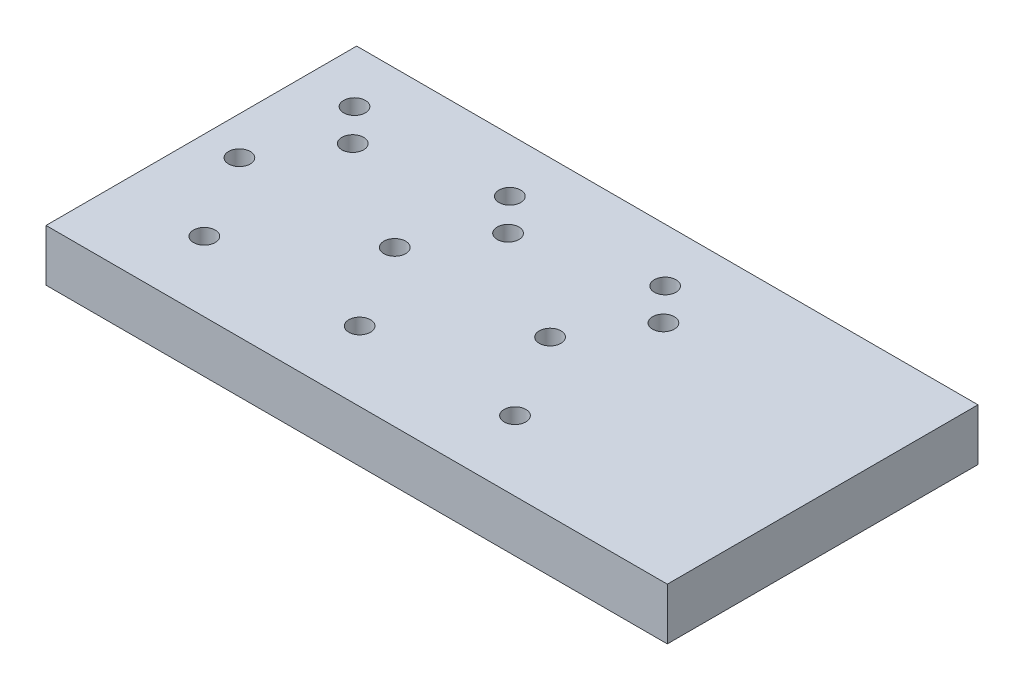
ISO-10303-21;
HEADER;
FILE_DESCRIPTION(('STEP AP214'),'2;1');
FILE_NAME('part.step','',(''),(''),'','','');
FILE_SCHEMA(('AUTOMOTIVE_DESIGN { 1 0 10303 214 1 1 1 1 }'));
ENDSEC;
DATA;
#1=APPLICATION_CONTEXT('core data for automotive mechanical design processes');
#2=APPLICATION_PROTOCOL_DEFINITION('international standard','automotive_design',2000,#1);
#3=PRODUCT_CONTEXT('',#1,'mechanical');
#4=PRODUCT('Part','Part','',(#3));
#5=PRODUCT_RELATED_PRODUCT_CATEGORY('part','',(#4));
#6=PRODUCT_DEFINITION_FORMATION('','',#4);
#7=PRODUCT_DEFINITION_CONTEXT('part definition',#1,'design');
#8=PRODUCT_DEFINITION('design','',#6,#7);
#9=PRODUCT_DEFINITION_SHAPE('','',#8);
#10=(LENGTH_UNIT() NAMED_UNIT(*) SI_UNIT(.MILLI.,.METRE.));
#11=(NAMED_UNIT(*) PLANE_ANGLE_UNIT() SI_UNIT($,.RADIAN.));
#12=(NAMED_UNIT(*) SI_UNIT($,.STERADIAN.) SOLID_ANGLE_UNIT());
#13=UNCERTAINTY_MEASURE_WITH_UNIT(LENGTH_MEASURE(1.E-05),#10,'distance_accuracy_value','');
#14=(GEOMETRIC_REPRESENTATION_CONTEXT(3) GLOBAL_UNCERTAINTY_ASSIGNED_CONTEXT((#13)) GLOBAL_UNIT_ASSIGNED_CONTEXT((#10,
#11,#12)) REPRESENTATION_CONTEXT('',''));
#15=CARTESIAN_POINT('',(0.,0.,0.));
#16=DIRECTION('',(0.,0.,1.));
#17=DIRECTION('',(1.,0.,0.));
#18=AXIS2_PLACEMENT_3D('',#15,#16,#17);
#19=CARTESIAN_POINT('',(60.,10.,-30.));
#20=DIRECTION('',(-1.,0.,0.));
#21=DIRECTION('',(0.,0.,1.));
#22=AXIS2_PLACEMENT_3D('',#19,#20,#21);
#23=PLANE('',#22);
#24=DIRECTION('',(0.,0.,-1.));
#25=VECTOR('',#24,1.);
#26=CARTESIAN_POINT('',(60.,0.,-30.));
#27=LINE('',#26,#25);
#28=CARTESIAN_POINT('',(60.,0.,30.));
#29=VERTEX_POINT('',#28);
#30=CARTESIAN_POINT('',(60.,0.,-30.));
#31=VERTEX_POINT('',#30);
#32=EDGE_CURVE('E102',#29,#31,#27,.T.);
#33=ORIENTED_EDGE('',*,*,#32,.T.);
#34=DIRECTION('',(0.,-1.,0.));
#35=VECTOR('',#34,1.);
#36=CARTESIAN_POINT('',(60.,10.,-30.));
#37=LINE('',#36,#35);
#38=CARTESIAN_POINT('',(60.,10.,-30.));
#39=VERTEX_POINT('',#38);
#40=EDGE_CURVE('E93',#39,#31,#37,.T.);
#41=ORIENTED_EDGE('',*,*,#40,.F.);
#42=DIRECTION('',(0.,0.,-1.));
#43=VECTOR('',#42,1.);
#44=CARTESIAN_POINT('',(60.,10.,-30.));
#45=LINE('',#44,#43);
#46=CARTESIAN_POINT('',(60.,10.,30.));
#47=VERTEX_POINT('',#46);
#48=EDGE_CURVE('E87',#47,#39,#45,.T.);
#49=ORIENTED_EDGE('',*,*,#48,.F.);
#50=DIRECTION('',(0.,-1.,0.));
#51=VECTOR('',#50,1.);
#52=CARTESIAN_POINT('',(60.,10.,30.));
#53=LINE('',#52,#51);
#54=EDGE_CURVE('E98',#47,#29,#53,.T.);
#55=ORIENTED_EDGE('',*,*,#54,.T.);
#56=EDGE_LOOP('',(#33,#41,#49,#55));
#57=FACE_BOUND('',#56,.T.);
#58=ADVANCED_FACE('F33',(#57),#23,.F.);
#59=CARTESIAN_POINT('',(60.,10.,-30.));
#60=DIRECTION('',(0.,0.,1.));
#61=DIRECTION('',(1.,0.,0.));
#62=AXIS2_PLACEMENT_3D('',#59,#60,#61);
#63=PLANE('',#62);
#64=DIRECTION('',(-1.,0.,0.));
#65=VECTOR('',#64,1.);
#66=CARTESIAN_POINT('',(60.,0.,-30.));
#67=LINE('',#66,#65);
#68=CARTESIAN_POINT('',(-60.,0.,-30.));
#69=VERTEX_POINT('',#68);
#70=EDGE_CURVE('E92',#31,#69,#67,.T.);
#71=ORIENTED_EDGE('',*,*,#70,.T.);
#72=DIRECTION('',(0.,-1.,0.));
#73=VECTOR('',#72,1.);
#74=CARTESIAN_POINT('',(-60.,10.,-30.));
#75=LINE('',#74,#73);
#76=CARTESIAN_POINT('',(-60.,10.,-30.));
#77=VERTEX_POINT('',#76);
#78=EDGE_CURVE('E90',#77,#69,#75,.T.);
#79=ORIENTED_EDGE('',*,*,#78,.F.);
#80=DIRECTION('',(-1.,0.,0.));
#81=VECTOR('',#80,1.);
#82=CARTESIAN_POINT('',(60.,10.,-30.));
#83=LINE('',#82,#81);
#84=EDGE_CURVE('E81',#39,#77,#83,.T.);
#85=ORIENTED_EDGE('',*,*,#84,.F.);
#86=ORIENTED_EDGE('',*,*,#40,.T.);
#87=EDGE_LOOP('',(#71,#79,#85,#86));
#88=FACE_BOUND('',#87,.T.);
#89=ADVANCED_FACE('F91',(#88),#63,.F.);
#90=CARTESIAN_POINT('',(-60.,10.,-30.));
#91=DIRECTION('',(1.,0.,0.));
#92=DIRECTION('',(0.,0.,-1.));
#93=AXIS2_PLACEMENT_3D('',#90,#91,#92);
#94=PLANE('',#93);
#95=DIRECTION('',(0.,0.,1.));
#96=VECTOR('',#95,1.);
#97=CARTESIAN_POINT('',(-60.,0.,-30.));
#98=LINE('',#97,#96);
#99=CARTESIAN_POINT('',(-60.,0.,30.));
#100=VERTEX_POINT('',#99);
#101=EDGE_CURVE('E67',#69,#100,#98,.T.);
#102=ORIENTED_EDGE('',*,*,#101,.T.);
#103=DIRECTION('',(0.,-1.,0.));
#104=VECTOR('',#103,1.);
#105=CARTESIAN_POINT('',(-60.,10.,30.));
#106=LINE('',#105,#104);
#107=CARTESIAN_POINT('',(-60.,10.,30.));
#108=VERTEX_POINT('',#107);
#109=EDGE_CURVE('E94',#108,#100,#106,.T.);
#110=ORIENTED_EDGE('',*,*,#109,.F.);
#111=DIRECTION('',(0.,0.,1.));
#112=VECTOR('',#111,1.);
#113=CARTESIAN_POINT('',(-60.,10.,-30.));
#114=LINE('',#113,#112);
#115=EDGE_CURVE('E85',#77,#108,#114,.T.);
#116=ORIENTED_EDGE('',*,*,#115,.F.);
#117=ORIENTED_EDGE('',*,*,#78,.T.);
#118=EDGE_LOOP('',(#102,#110,#116,#117));
#119=FACE_BOUND('',#118,.T.);
#120=ADVANCED_FACE('F96',(#119),#94,.F.);
#121=CARTESIAN_POINT('',(60.,10.,30.));
#122=DIRECTION('',(0.,0.,-1.));
#123=DIRECTION('',(-1.,0.,0.));
#124=AXIS2_PLACEMENT_3D('',#121,#122,#123);
#125=PLANE('',#124);
#126=DIRECTION('',(1.,0.,0.));
#127=VECTOR('',#126,1.);
#128=CARTESIAN_POINT('',(60.,0.,30.));
#129=LINE('',#128,#127);
#130=EDGE_CURVE('E73',#100,#29,#129,.T.);
#131=ORIENTED_EDGE('',*,*,#130,.T.);
#132=ORIENTED_EDGE('',*,*,#54,.F.);
#133=DIRECTION('',(1.,0.,0.));
#134=VECTOR('',#133,1.);
#135=CARTESIAN_POINT('',(60.,10.,30.));
#136=LINE('',#135,#134);
#137=EDGE_CURVE('E50',#108,#47,#136,.T.);
#138=ORIENTED_EDGE('',*,*,#137,.F.);
#139=ORIENTED_EDGE('',*,*,#109,.T.);
#140=EDGE_LOOP('',(#131,#132,#138,#139));
#141=FACE_BOUND('',#140,.T.);
#142=ADVANCED_FACE('F161',(#141),#125,.F.);
#143=CARTESIAN_POINT('',(60.,10.,30.));
#144=DIRECTION('',(0.,-1.,0.));
#145=DIRECTION('',(0.,0.,-1.));
#146=AXIS2_PLACEMENT_3D('',#143,#144,#145);
#147=PLANE('',#146);
#148=CARTESIAN_POINT('',(-22.6459660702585,10.,0.));
#149=DIRECTION('',(0.,1.,0.));
#150=DIRECTION('',(0.,0.,1.));
#151=AXIS2_PLACEMENT_3D('',#148,#149,#150);
#152=CIRCLE('',#151,2.09999999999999);
#153=CARTESIAN_POINT('',(-22.6459660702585,10.,2.09999999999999));
#154=VERTEX_POINT('',#153);
#155=EDGE_CURVE('E358',#154,#154,#152,.T.);
#156=ORIENTED_EDGE('',*,*,#155,.F.);
#157=EDGE_LOOP('',(#156));
#158=FACE_BOUND('',#157,.T.);
#159=CARTESIAN_POINT('',(-14.0694165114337,10.,-13.312797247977));
#160=DIRECTION('',(0.,1.,0.));
#161=DIRECTION('',(0.,0.,1.));
#162=AXIS2_PLACEMENT_3D('',#159,#160,#161);
#163=CIRCLE('',#162,2.09999999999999);
#164=CARTESIAN_POINT('',(-14.0694165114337,10.,-11.212797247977));
#165=VERTEX_POINT('',#164);
#166=EDGE_CURVE('E352',#165,#165,#163,.T.);
#167=ORIENTED_EDGE('',*,*,#166,.F.);
#168=EDGE_LOOP('',(#167));
#169=FACE_BOUND('',#168,.T.);
#170=CARTESIAN_POINT('',(-20.0812472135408,10.,-19.6611191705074));
#171=DIRECTION('',(0.,1.,0.));
#172=DIRECTION('',(0.,0.,1.));
#173=AXIS2_PLACEMENT_3D('',#170,#171,#172);
#174=CIRCLE('',#173,2.09999999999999);
#175=CARTESIAN_POINT('',(-20.0812472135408,10.,-17.5611191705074));
#176=VERTEX_POINT('',#175);
#177=EDGE_CURVE('E346',#176,#176,#174,.T.);
#178=ORIENTED_EDGE('',*,*,#177,.F.);
#179=EDGE_LOOP('',(#178));
#180=FACE_BOUND('',#179,.T.);
#181=CARTESIAN_POINT('',(-12.8913139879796,10.,16.5317198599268));
#182=DIRECTION('',(0.,1.,0.));
#183=DIRECTION('',(0.,0.,1.));
#184=AXIS2_PLACEMENT_3D('',#181,#182,#183);
#185=CIRCLE('',#184,2.09999999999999);
#186=CARTESIAN_POINT('',(-12.8913139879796,10.,18.6317198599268));
#187=VERTEX_POINT('',#186);
#188=EDGE_CURVE('E340',#187,#187,#185,.T.);
#189=ORIENTED_EDGE('',*,*,#188,.F.);
#190=EDGE_LOOP('',(#189));
#191=FACE_BOUND('',#190,.T.);
#192=CARTESIAN_POINT('',(-42.8913139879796,10.,16.5317198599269));
#193=DIRECTION('',(0.,1.,0.));
#194=DIRECTION('',(0.,0.,1.));
#195=AXIS2_PLACEMENT_3D('',#192,#193,#194);
#196=CIRCLE('',#195,2.09999999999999);
#197=CARTESIAN_POINT('',(-42.8913139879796,10.,18.6317198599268));
#198=VERTEX_POINT('',#197);
#199=EDGE_CURVE('E127',#198,#198,#196,.T.);
#200=ORIENTED_EDGE('',*,*,#199,.F.);
#201=EDGE_LOOP('',(#200));
#202=FACE_BOUND('',#201,.T.);
#203=CARTESIAN_POINT('',(-52.6459660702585,10.,0.));
#204=DIRECTION('',(0.,1.,0.));
#205=DIRECTION('',(0.,0.,1.));
#206=AXIS2_PLACEMENT_3D('',#203,#204,#205);
#207=CIRCLE('',#206,2.09999999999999);
#208=CARTESIAN_POINT('',(-52.6459660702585,10.,2.09999999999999));
#209=VERTEX_POINT('',#208);
#210=EDGE_CURVE('E123',#209,#209,#207,.T.);
#211=ORIENTED_EDGE('',*,*,#210,.F.);
#212=EDGE_LOOP('',(#211));
#213=FACE_BOUND('',#212,.T.);
#214=CARTESIAN_POINT('',(-44.0694165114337,10.,-13.312797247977));
#215=DIRECTION('',(0.,1.,0.));
#216=DIRECTION('',(0.,0.,1.));
#217=AXIS2_PLACEMENT_3D('',#214,#215,#216);
#218=CIRCLE('',#217,2.09999999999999);
#219=CARTESIAN_POINT('',(-44.0694165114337,10.,-11.212797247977));
#220=VERTEX_POINT('',#219);
#221=EDGE_CURVE('E119',#220,#220,#218,.T.);
#222=ORIENTED_EDGE('',*,*,#221,.F.);
#223=EDGE_LOOP('',(#222));
#224=FACE_BOUND('',#223,.T.);
#225=CARTESIAN_POINT('',(-50.0812472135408,10.,-19.6611191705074));
#226=DIRECTION('',(0.,1.,0.));
#227=DIRECTION('',(0.,0.,1.));
#228=AXIS2_PLACEMENT_3D('',#225,#226,#227);
#229=CIRCLE('',#228,2.09999999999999);
#230=CARTESIAN_POINT('',(-50.0812472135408,10.,-17.5611191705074));
#231=VERTEX_POINT('',#230);
#232=EDGE_CURVE('E115',#231,#231,#229,.T.);
#233=ORIENTED_EDGE('',*,*,#232,.F.);
#234=EDGE_LOOP('',(#233));
#235=FACE_BOUND('',#234,.T.);
#236=ORIENTED_EDGE('',*,*,#48,.T.);
#237=ORIENTED_EDGE('',*,*,#84,.T.);
#238=ORIENTED_EDGE('',*,*,#115,.T.);
#239=ORIENTED_EDGE('',*,*,#137,.T.);
#240=EDGE_LOOP('',(#236,#237,#238,#239));
#241=FACE_BOUND('',#240,.T.);
#242=CARTESIAN_POINT('',(17.1086860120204,10.,16.5317198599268));
#243=DIRECTION('',(0.,1.,0.));
#244=DIRECTION('',(0.,0.,1.));
#245=AXIS2_PLACEMENT_3D('',#242,#243,#244);
#246=CIRCLE('',#245,2.09999999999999);
#247=CARTESIAN_POINT('',(17.1086860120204,10.,18.6317198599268));
#248=VERTEX_POINT('',#247);
#249=EDGE_CURVE('E130',#248,#248,#246,.T.);
#250=ORIENTED_EDGE('',*,*,#249,.F.);
#251=EDGE_LOOP('',(#250));
#252=FACE_BOUND('',#251,.T.);
#253=CARTESIAN_POINT('',(9.91875278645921,10.,-19.6611191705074));
#254=DIRECTION('',(0.,1.,0.));
#255=DIRECTION('',(0.,0.,1.));
#256=AXIS2_PLACEMENT_3D('',#253,#254,#255);
#257=CIRCLE('',#256,2.09999999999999);
#258=CARTESIAN_POINT('',(9.91875278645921,10.,-17.5611191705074));
#259=VERTEX_POINT('',#258);
#260=EDGE_CURVE('E136',#259,#259,#257,.T.);
#261=ORIENTED_EDGE('',*,*,#260,.F.);
#262=EDGE_LOOP('',(#261));
#263=FACE_BOUND('',#262,.T.);
#264=CARTESIAN_POINT('',(15.9305834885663,10.,-13.312797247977));
#265=DIRECTION('',(0.,1.,0.));
#266=DIRECTION('',(0.,0.,1.));
#267=AXIS2_PLACEMENT_3D('',#264,#265,#266);
#268=CIRCLE('',#267,2.09999999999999);
#269=CARTESIAN_POINT('',(15.9305834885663,10.,-11.212797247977));
#270=VERTEX_POINT('',#269);
#271=EDGE_CURVE('E142',#270,#270,#268,.T.);
#272=ORIENTED_EDGE('',*,*,#271,.F.);
#273=EDGE_LOOP('',(#272));
#274=FACE_BOUND('',#273,.T.);
#275=CARTESIAN_POINT('',(7.35403392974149,10.,0.));
#276=DIRECTION('',(0.,1.,0.));
#277=DIRECTION('',(0.,0.,1.));
#278=AXIS2_PLACEMENT_3D('',#275,#276,#277);
#279=CIRCLE('',#278,2.09999999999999);
#280=CARTESIAN_POINT('',(7.35403392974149,10.,2.09999999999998));
#281=VERTEX_POINT('',#280);
#282=EDGE_CURVE('E11',#281,#281,#279,.T.);
#283=ORIENTED_EDGE('',*,*,#282,.F.);
#284=EDGE_LOOP('',(#283));
#285=FACE_BOUND('',#284,.T.);
#286=ADVANCED_FACE('F82',(#158,#169,#180,#191,#202,#213,#224,#235,#241,#252,#263,#274,#285),
#147,.F.);
#287=CARTESIAN_POINT('',(60.,0.,30.));
#288=DIRECTION('',(0.,-1.,0.));
#289=DIRECTION('',(0.,0.,-1.));
#290=AXIS2_PLACEMENT_3D('',#287,#288,#289);
#291=PLANE('',#290);
#292=CARTESIAN_POINT('',(-22.6459660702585,0.,0.));
#293=DIRECTION('',(0.,-1.,0.));
#294=DIRECTION('',(0.,0.,-1.));
#295=AXIS2_PLACEMENT_3D('',#292,#293,#294);
#296=CIRCLE('',#295,2.09999999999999);
#297=CARTESIAN_POINT('',(-22.6459660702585,0.,-2.09999999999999));
#298=VERTEX_POINT('',#297);
#299=EDGE_CURVE('E361',#298,#298,#296,.T.);
#300=ORIENTED_EDGE('',*,*,#299,.F.);
#301=EDGE_LOOP('',(#300));
#302=FACE_BOUND('',#301,.T.);
#303=CARTESIAN_POINT('',(-14.0694165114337,0.,-13.312797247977));
#304=DIRECTION('',(0.,-1.,0.));
#305=DIRECTION('',(0.,0.,-1.));
#306=AXIS2_PLACEMENT_3D('',#303,#304,#305);
#307=CIRCLE('',#306,2.09999999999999);
#308=CARTESIAN_POINT('',(-14.0694165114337,0.,-15.412797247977));
#309=VERTEX_POINT('',#308);
#310=EDGE_CURVE('E355',#309,#309,#307,.T.);
#311=ORIENTED_EDGE('',*,*,#310,.F.);
#312=EDGE_LOOP('',(#311));
#313=FACE_BOUND('',#312,.T.);
#314=CARTESIAN_POINT('',(-20.0812472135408,0.,-19.6611191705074));
#315=DIRECTION('',(0.,-1.,0.));
#316=DIRECTION('',(0.,0.,-1.));
#317=AXIS2_PLACEMENT_3D('',#314,#315,#316);
#318=CIRCLE('',#317,2.09999999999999);
#319=CARTESIAN_POINT('',(-20.0812472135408,0.,-21.7611191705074));
#320=VERTEX_POINT('',#319);
#321=EDGE_CURVE('E349',#320,#320,#318,.T.);
#322=ORIENTED_EDGE('',*,*,#321,.F.);
#323=EDGE_LOOP('',(#322));
#324=FACE_BOUND('',#323,.T.);
#325=CARTESIAN_POINT('',(-12.8913139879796,0.,16.5317198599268));
#326=DIRECTION('',(0.,-1.,0.));
#327=DIRECTION('',(0.,0.,-1.));
#328=AXIS2_PLACEMENT_3D('',#325,#326,#327);
#329=CIRCLE('',#328,2.09999999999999);
#330=CARTESIAN_POINT('',(-12.8913139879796,0.,14.4317198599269));
#331=VERTEX_POINT('',#330);
#332=EDGE_CURVE('E343',#331,#331,#329,.T.);
#333=ORIENTED_EDGE('',*,*,#332,.F.);
#334=EDGE_LOOP('',(#333));
#335=FACE_BOUND('',#334,.T.);
#336=CARTESIAN_POINT('',(-42.8913139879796,0.,16.5317198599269));
#337=DIRECTION('',(0.,-1.,0.));
#338=DIRECTION('',(0.,0.,-1.));
#339=AXIS2_PLACEMENT_3D('',#336,#337,#338);
#340=CIRCLE('',#339,2.09999999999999);
#341=CARTESIAN_POINT('',(-42.8913139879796,0.,14.4317198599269));
#342=VERTEX_POINT('',#341);
#343=EDGE_CURVE('E124',#342,#342,#340,.T.);
#344=ORIENTED_EDGE('',*,*,#343,.F.);
#345=EDGE_LOOP('',(#344));
#346=FACE_BOUND('',#345,.T.);
#347=CARTESIAN_POINT('',(-52.6459660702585,0.,0.));
#348=DIRECTION('',(0.,-1.,0.));
#349=DIRECTION('',(0.,0.,-1.));
#350=AXIS2_PLACEMENT_3D('',#347,#348,#349);
#351=CIRCLE('',#350,2.09999999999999);
#352=CARTESIAN_POINT('',(-52.6459660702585,0.,-2.09999999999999));
#353=VERTEX_POINT('',#352);
#354=EDGE_CURVE('E120',#353,#353,#351,.T.);
#355=ORIENTED_EDGE('',*,*,#354,.F.);
#356=EDGE_LOOP('',(#355));
#357=FACE_BOUND('',#356,.T.);
#358=CARTESIAN_POINT('',(-44.0694165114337,0.,-13.312797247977));
#359=DIRECTION('',(0.,-1.,0.));
#360=DIRECTION('',(0.,0.,-1.));
#361=AXIS2_PLACEMENT_3D('',#358,#359,#360);
#362=CIRCLE('',#361,2.09999999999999);
#363=CARTESIAN_POINT('',(-44.0694165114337,0.,-15.412797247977));
#364=VERTEX_POINT('',#363);
#365=EDGE_CURVE('E116',#364,#364,#362,.T.);
#366=ORIENTED_EDGE('',*,*,#365,.F.);
#367=EDGE_LOOP('',(#366));
#368=FACE_BOUND('',#367,.T.);
#369=CARTESIAN_POINT('',(-50.0812472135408,0.,-19.6611191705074));
#370=DIRECTION('',(0.,-1.,0.));
#371=DIRECTION('',(0.,0.,-1.));
#372=AXIS2_PLACEMENT_3D('',#369,#370,#371);
#373=CIRCLE('',#372,2.09999999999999);
#374=CARTESIAN_POINT('',(-50.0812472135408,0.,-21.7611191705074));
#375=VERTEX_POINT('',#374);
#376=EDGE_CURVE('E105',#375,#375,#373,.T.);
#377=ORIENTED_EDGE('',*,*,#376,.F.);
#378=EDGE_LOOP('',(#377));
#379=FACE_BOUND('',#378,.T.);
#380=ORIENTED_EDGE('',*,*,#32,.F.);
#381=ORIENTED_EDGE('',*,*,#130,.F.);
#382=ORIENTED_EDGE('',*,*,#101,.F.);
#383=ORIENTED_EDGE('',*,*,#70,.F.);
#384=EDGE_LOOP('',(#380,#381,#382,#383));
#385=FACE_BOUND('',#384,.T.);
#386=CARTESIAN_POINT('',(17.1086860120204,0.,16.5317198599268));
#387=DIRECTION('',(0.,-1.,0.));
#388=DIRECTION('',(0.,0.,-1.));
#389=AXIS2_PLACEMENT_3D('',#386,#387,#388);
#390=CIRCLE('',#389,2.09999999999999);
#391=CARTESIAN_POINT('',(17.1086860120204,0.,14.4317198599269));
#392=VERTEX_POINT('',#391);
#393=EDGE_CURVE('E112',#392,#392,#390,.T.);
#394=ORIENTED_EDGE('',*,*,#393,.F.);
#395=EDGE_LOOP('',(#394));
#396=FACE_BOUND('',#395,.T.);
#397=CARTESIAN_POINT('',(9.91875278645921,0.,-19.6611191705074));
#398=DIRECTION('',(0.,-1.,0.));
#399=DIRECTION('',(0.,0.,-1.));
#400=AXIS2_PLACEMENT_3D('',#397,#398,#399);
#401=CIRCLE('',#400,2.09999999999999);
#402=CARTESIAN_POINT('',(9.91875278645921,0.,-21.7611191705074));
#403=VERTEX_POINT('',#402);
#404=EDGE_CURVE('E133',#403,#403,#401,.T.);
#405=ORIENTED_EDGE('',*,*,#404,.F.);
#406=EDGE_LOOP('',(#405));
#407=FACE_BOUND('',#406,.T.);
#408=CARTESIAN_POINT('',(15.9305834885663,0.,-13.312797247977));
#409=DIRECTION('',(0.,-1.,0.));
#410=DIRECTION('',(0.,0.,-1.));
#411=AXIS2_PLACEMENT_3D('',#408,#409,#410);
#412=CIRCLE('',#411,2.09999999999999);
#413=CARTESIAN_POINT('',(15.9305834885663,0.,-15.412797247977));
#414=VERTEX_POINT('',#413);
#415=EDGE_CURVE('E139',#414,#414,#412,.T.);
#416=ORIENTED_EDGE('',*,*,#415,.F.);
#417=EDGE_LOOP('',(#416));
#418=FACE_BOUND('',#417,.T.);
#419=CARTESIAN_POINT('',(7.35403392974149,0.,0.));
#420=DIRECTION('',(0.,-1.,0.));
#421=DIRECTION('',(0.,0.,-1.));
#422=AXIS2_PLACEMENT_3D('',#419,#420,#421);
#423=CIRCLE('',#422,2.09999999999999);
#424=CARTESIAN_POINT('',(7.35403392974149,0.,-2.1));
#425=VERTEX_POINT('',#424);
#426=EDGE_CURVE('E42',#425,#425,#423,.T.);
#427=ORIENTED_EDGE('',*,*,#426,.F.);
#428=EDGE_LOOP('',(#427));
#429=FACE_BOUND('',#428,.T.);
#430=ADVANCED_FACE('F149',(#302,#313,#324,#335,#346,#357,#368,#379,#385,#396,#407,#418,#429),
#291,.T.);
#431=CARTESIAN_POINT('',(-50.0812472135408,10.,-19.6611191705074));
#432=DIRECTION('',(0.,1.,0.));
#433=DIRECTION('',(0.,0.,1.));
#434=AXIS2_PLACEMENT_3D('',#431,#432,#433);
#435=CYLINDRICAL_SURFACE('',#434,2.09999999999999);
#436=ORIENTED_EDGE('',*,*,#376,.T.);
#437=EDGE_LOOP('',(#436));
#438=FACE_BOUND('',#437,.T.);
#439=ORIENTED_EDGE('',*,*,#232,.T.);
#440=EDGE_LOOP('',(#439));
#441=FACE_BOUND('',#440,.T.);
#442=ADVANCED_FACE('F151',(#438,#441),#435,.F.);
#443=CARTESIAN_POINT('',(-44.0694165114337,10.,-13.312797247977));
#444=DIRECTION('',(0.,1.,0.));
#445=DIRECTION('',(0.,0.,1.));
#446=AXIS2_PLACEMENT_3D('',#443,#444,#445);
#447=CYLINDRICAL_SURFACE('',#446,2.09999999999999);
#448=ORIENTED_EDGE('',*,*,#365,.T.);
#449=EDGE_LOOP('',(#448));
#450=FACE_BOUND('',#449,.T.);
#451=ORIENTED_EDGE('',*,*,#221,.T.);
#452=EDGE_LOOP('',(#451));
#453=FACE_BOUND('',#452,.T.);
#454=ADVANCED_FACE('F158',(#450,#453),#447,.F.);
#455=CARTESIAN_POINT('',(-52.6459660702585,10.,0.));
#456=DIRECTION('',(0.,1.,0.));
#457=DIRECTION('',(0.,0.,1.));
#458=AXIS2_PLACEMENT_3D('',#455,#456,#457);
#459=CYLINDRICAL_SURFACE('',#458,2.09999999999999);
#460=ORIENTED_EDGE('',*,*,#354,.T.);
#461=EDGE_LOOP('',(#460));
#462=FACE_BOUND('',#461,.T.);
#463=ORIENTED_EDGE('',*,*,#210,.T.);
#464=EDGE_LOOP('',(#463));
#465=FACE_BOUND('',#464,.T.);
#466=ADVANCED_FACE('F274',(#462,#465),#459,.F.);
#467=CARTESIAN_POINT('',(-42.8913139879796,10.,16.5317198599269));
#468=DIRECTION('',(0.,1.,0.));
#469=DIRECTION('',(0.,0.,1.));
#470=AXIS2_PLACEMENT_3D('',#467,#468,#469);
#471=CYLINDRICAL_SURFACE('',#470,2.09999999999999);
#472=ORIENTED_EDGE('',*,*,#343,.T.);
#473=EDGE_LOOP('',(#472));
#474=FACE_BOUND('',#473,.T.);
#475=ORIENTED_EDGE('',*,*,#199,.T.);
#476=EDGE_LOOP('',(#475));
#477=FACE_BOUND('',#476,.T.);
#478=ADVANCED_FACE('F250',(#474,#477),#471,.F.);
#479=CARTESIAN_POINT('',(-12.8913139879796,10.,16.5317198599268));
#480=DIRECTION('',(0.,1.,0.));
#481=DIRECTION('',(0.,0.,1.));
#482=AXIS2_PLACEMENT_3D('',#479,#480,#481);
#483=CYLINDRICAL_SURFACE('',#482,2.09999999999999);
#484=ORIENTED_EDGE('',*,*,#332,.T.);
#485=EDGE_LOOP('',(#484));
#486=FACE_BOUND('',#485,.T.);
#487=ORIENTED_EDGE('',*,*,#188,.T.);
#488=EDGE_LOOP('',(#487));
#489=FACE_BOUND('',#488,.T.);
#490=ADVANCED_FACE('F180',(#486,#489),#483,.F.);
#491=CARTESIAN_POINT('',(17.1086860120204,10.,16.5317198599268));
#492=DIRECTION('',(0.,1.,0.));
#493=DIRECTION('',(0.,0.,1.));
#494=AXIS2_PLACEMENT_3D('',#491,#492,#493);
#495=CYLINDRICAL_SURFACE('',#494,2.09999999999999);
#496=ORIENTED_EDGE('',*,*,#393,.T.);
#497=EDGE_LOOP('',(#496));
#498=FACE_BOUND('',#497,.T.);
#499=ORIENTED_EDGE('',*,*,#249,.T.);
#500=EDGE_LOOP('',(#499));
#501=FACE_BOUND('',#500,.T.);
#502=ADVANCED_FACE('F176',(#498,#501),#495,.F.);
#503=CARTESIAN_POINT('',(-20.0812472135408,10.,-19.6611191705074));
#504=DIRECTION('',(0.,1.,0.));
#505=DIRECTION('',(0.,0.,1.));
#506=AXIS2_PLACEMENT_3D('',#503,#504,#505);
#507=CYLINDRICAL_SURFACE('',#506,2.09999999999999);
#508=ORIENTED_EDGE('',*,*,#321,.T.);
#509=EDGE_LOOP('',(#508));
#510=FACE_BOUND('',#509,.T.);
#511=ORIENTED_EDGE('',*,*,#177,.T.);
#512=EDGE_LOOP('',(#511));
#513=FACE_BOUND('',#512,.T.);
#514=ADVANCED_FACE('F179',(#510,#513),#507,.F.);
#515=CARTESIAN_POINT('',(9.91875278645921,10.,-19.6611191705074));
#516=DIRECTION('',(0.,1.,0.));
#517=DIRECTION('',(0.,0.,1.));
#518=AXIS2_PLACEMENT_3D('',#515,#516,#517);
#519=CYLINDRICAL_SURFACE('',#518,2.09999999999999);
#520=ORIENTED_EDGE('',*,*,#404,.T.);
#521=EDGE_LOOP('',(#520));
#522=FACE_BOUND('',#521,.T.);
#523=ORIENTED_EDGE('',*,*,#260,.T.);
#524=EDGE_LOOP('',(#523));
#525=FACE_BOUND('',#524,.T.);
#526=ADVANCED_FACE('F182',(#522,#525),#519,.F.);
#527=CARTESIAN_POINT('',(-14.0694165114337,10.,-13.312797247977));
#528=DIRECTION('',(0.,1.,0.));
#529=DIRECTION('',(0.,0.,1.));
#530=AXIS2_PLACEMENT_3D('',#527,#528,#529);
#531=CYLINDRICAL_SURFACE('',#530,2.09999999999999);
#532=ORIENTED_EDGE('',*,*,#310,.T.);
#533=EDGE_LOOP('',(#532));
#534=FACE_BOUND('',#533,.T.);
#535=ORIENTED_EDGE('',*,*,#166,.T.);
#536=EDGE_LOOP('',(#535));
#537=FACE_BOUND('',#536,.T.);
#538=ADVANCED_FACE('F184',(#534,#537),#531,.F.);
#539=CARTESIAN_POINT('',(15.9305834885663,10.,-13.312797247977));
#540=DIRECTION('',(0.,1.,0.));
#541=DIRECTION('',(0.,0.,1.));
#542=AXIS2_PLACEMENT_3D('',#539,#540,#541);
#543=CYLINDRICAL_SURFACE('',#542,2.09999999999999);
#544=ORIENTED_EDGE('',*,*,#415,.T.);
#545=EDGE_LOOP('',(#544));
#546=FACE_BOUND('',#545,.T.);
#547=ORIENTED_EDGE('',*,*,#271,.T.);
#548=EDGE_LOOP('',(#547));
#549=FACE_BOUND('',#548,.T.);
#550=ADVANCED_FACE('F186',(#546,#549),#543,.F.);
#551=CARTESIAN_POINT('',(-22.6459660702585,10.,0.));
#552=DIRECTION('',(0.,1.,0.));
#553=DIRECTION('',(0.,0.,1.));
#554=AXIS2_PLACEMENT_3D('',#551,#552,#553);
#555=CYLINDRICAL_SURFACE('',#554,2.09999999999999);
#556=ORIENTED_EDGE('',*,*,#299,.T.);
#557=EDGE_LOOP('',(#556));
#558=FACE_BOUND('',#557,.T.);
#559=ORIENTED_EDGE('',*,*,#155,.T.);
#560=EDGE_LOOP('',(#559));
#561=FACE_BOUND('',#560,.T.);
#562=ADVANCED_FACE('F188',(#558,#561),#555,.F.);
#563=CARTESIAN_POINT('',(7.35403392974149,10.,0.));
#564=DIRECTION('',(0.,1.,0.));
#565=DIRECTION('',(0.,0.,1.));
#566=AXIS2_PLACEMENT_3D('',#563,#564,#565);
#567=CYLINDRICAL_SURFACE('',#566,2.09999999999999);
#568=ORIENTED_EDGE('',*,*,#426,.T.);
#569=EDGE_LOOP('',(#568));
#570=FACE_BOUND('',#569,.T.);
#571=ORIENTED_EDGE('',*,*,#282,.T.);
#572=EDGE_LOOP('',(#571));
#573=FACE_BOUND('',#572,.T.);
#574=ADVANCED_FACE('F35',(#570,#573),#567,.F.);
#575=CLOSED_SHELL('',(#58,#89,#120,#142,#286,#430,#442,#454,#466,#478,#490,#502,#514,#526,#538,
#550,#562,#574));
#576=MANIFOLD_SOLID_BREP('B2',#575);
#577=ADVANCED_BREP_SHAPE_REPRESENTATION('',(#18,#576),#14);
#578=SHAPE_DEFINITION_REPRESENTATION(#9,#577);
ENDSEC;
END-ISO-10303-21;
